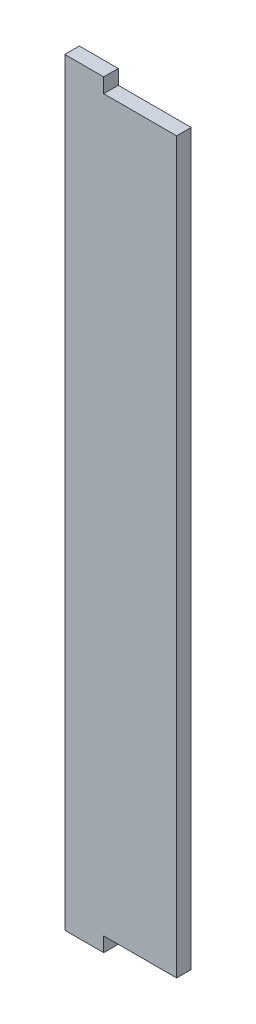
ISO-10303-21;
HEADER;
FILE_DESCRIPTION(('STEP AP214'),'2;1');
FILE_NAME('part.step','',(''),(''),'','','');
FILE_SCHEMA(('AUTOMOTIVE_DESIGN { 1 0 10303 214 1 1 1 1 }'));
ENDSEC;
DATA;
#1=APPLICATION_CONTEXT('core data for automotive mechanical design processes');
#2=APPLICATION_PROTOCOL_DEFINITION('international standard','automotive_design',2000,#1);
#3=PRODUCT_CONTEXT('',#1,'mechanical');
#4=PRODUCT('Part','Part','',(#3));
#5=PRODUCT_RELATED_PRODUCT_CATEGORY('part','',(#4));
#6=PRODUCT_DEFINITION_FORMATION('','',#4);
#7=PRODUCT_DEFINITION_CONTEXT('part definition',#1,'design');
#8=PRODUCT_DEFINITION('design','',#6,#7);
#9=PRODUCT_DEFINITION_SHAPE('','',#8);
#10=(LENGTH_UNIT() NAMED_UNIT(*) SI_UNIT(.MILLI.,.METRE.));
#11=(NAMED_UNIT(*) PLANE_ANGLE_UNIT() SI_UNIT($,.RADIAN.));
#12=(NAMED_UNIT(*) SI_UNIT($,.STERADIAN.) SOLID_ANGLE_UNIT());
#13=UNCERTAINTY_MEASURE_WITH_UNIT(LENGTH_MEASURE(1.E-05),#10,'distance_accuracy_value','');
#14=(GEOMETRIC_REPRESENTATION_CONTEXT(3) GLOBAL_UNCERTAINTY_ASSIGNED_CONTEXT((#13)) GLOBAL_UNIT_ASSIGNED_CONTEXT((#10,
#11,#12)) REPRESENTATION_CONTEXT('',''));
#15=CARTESIAN_POINT('',(0.,0.,0.));
#16=DIRECTION('',(0.,0.,1.));
#17=DIRECTION('',(1.,0.,0.));
#18=AXIS2_PLACEMENT_3D('',#15,#16,#17);
#19=CARTESIAN_POINT('',(-11.5,75.,3.));
#20=DIRECTION('',(0.,-1.,0.));
#21=DIRECTION('',(0.,0.,-1.));
#22=AXIS2_PLACEMENT_3D('',#19,#20,#21);
#23=PLANE('',#22);
#24=DIRECTION('',(0.,0.,-1.));
#25=VECTOR('',#24,1.);
#26=CARTESIAN_POINT('',(-3.50000000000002,75.,3.));
#27=LINE('',#26,#25);
#28=CARTESIAN_POINT('',(-3.50000000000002,75.,3.));
#29=VERTEX_POINT('',#28);
#30=CARTESIAN_POINT('',(-3.50000000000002,75.,0.));
#31=VERTEX_POINT('',#30);
#32=EDGE_CURVE('E58',#29,#31,#27,.T.);
#33=ORIENTED_EDGE('',*,*,#32,.F.);
#34=DIRECTION('',(-1.,0.,0.));
#35=VECTOR('',#34,1.);
#36=CARTESIAN_POINT('',(-11.5,75.,3.));
#37=LINE('',#36,#35);
#38=CARTESIAN_POINT('',(11.5,75.,3.));
#39=VERTEX_POINT('',#38);
#40=EDGE_CURVE('E114',#39,#29,#37,.T.);
#41=ORIENTED_EDGE('',*,*,#40,.F.);
#42=DIRECTION('',(0.,0.,-1.));
#43=VECTOR('',#42,1.);
#44=CARTESIAN_POINT('',(11.5,75.,3.));
#45=LINE('',#44,#43);
#46=CARTESIAN_POINT('',(11.5,75.,0.));
#47=VERTEX_POINT('',#46);
#48=EDGE_CURVE('E11',#39,#47,#45,.T.);
#49=ORIENTED_EDGE('',*,*,#48,.T.);
#50=DIRECTION('',(-1.,0.,0.));
#51=VECTOR('',#50,1.);
#52=CARTESIAN_POINT('',(-11.5,75.,0.));
#53=LINE('',#52,#51);
#54=EDGE_CURVE('E158',#47,#31,#53,.T.);
#55=ORIENTED_EDGE('',*,*,#54,.T.);
#56=EDGE_LOOP('',(#33,#41,#49,#55));
#57=FACE_BOUND('',#56,.T.);
#58=ADVANCED_FACE('F35',(#57),#23,.F.);
#59=CARTESIAN_POINT('',(11.5,-75.,3.));
#60=DIRECTION('',(-1.,0.,0.));
#61=DIRECTION('',(0.,0.,1.));
#62=AXIS2_PLACEMENT_3D('',#59,#60,#61);
#63=PLANE('',#62);
#64=DIRECTION('',(0.,1.,0.));
#65=VECTOR('',#64,1.);
#66=CARTESIAN_POINT('',(11.5,-75.,0.));
#67=LINE('',#66,#65);
#68=CARTESIAN_POINT('',(11.5,-75.,0.));
#69=VERTEX_POINT('',#68);
#70=EDGE_CURVE('E150',#69,#47,#67,.T.);
#71=ORIENTED_EDGE('',*,*,#70,.T.);
#72=ORIENTED_EDGE('',*,*,#48,.F.);
#73=DIRECTION('',(0.,1.,0.));
#74=VECTOR('',#73,1.);
#75=CARTESIAN_POINT('',(11.5,-75.,3.));
#76=LINE('',#75,#74);
#77=CARTESIAN_POINT('',(11.5,-75.,3.));
#78=VERTEX_POINT('',#77);
#79=EDGE_CURVE('E151',#78,#39,#76,.T.);
#80=ORIENTED_EDGE('',*,*,#79,.F.);
#81=DIRECTION('',(0.,0.,-1.));
#82=VECTOR('',#81,1.);
#83=CARTESIAN_POINT('',(11.5,-75.,3.));
#84=LINE('',#83,#82);
#85=EDGE_CURVE('E43',#78,#69,#84,.T.);
#86=ORIENTED_EDGE('',*,*,#85,.T.);
#87=EDGE_LOOP('',(#71,#72,#80,#86));
#88=FACE_BOUND('',#87,.T.);
#89=ADVANCED_FACE('F37',(#88),#63,.F.);
#90=CARTESIAN_POINT('',(-11.5,-75.,3.));
#91=DIRECTION('',(1.,0.,0.));
#92=DIRECTION('',(0.,0.,-1.));
#93=AXIS2_PLACEMENT_3D('',#90,#91,#92);
#94=PLANE('',#93);
#95=DIRECTION('',(0.,-1.,0.));
#96=VECTOR('',#95,1.);
#97=CARTESIAN_POINT('',(-11.5,-75.,0.));
#98=LINE('',#97,#96);
#99=CARTESIAN_POINT('',(-11.5,78.,0.));
#100=VERTEX_POINT('',#99);
#101=CARTESIAN_POINT('',(-11.5,-78.,0.));
#102=VERTEX_POINT('',#101);
#103=EDGE_CURVE('E119',#100,#102,#98,.T.);
#104=ORIENTED_EDGE('',*,*,#103,.T.);
#105=DIRECTION('',(0.,0.,-1.));
#106=VECTOR('',#105,1.);
#107=CARTESIAN_POINT('',(-11.5,-78.,3.));
#108=LINE('',#107,#106);
#109=CARTESIAN_POINT('',(-11.5,-78.,3.));
#110=VERTEX_POINT('',#109);
#111=EDGE_CURVE('E117',#110,#102,#108,.T.);
#112=ORIENTED_EDGE('',*,*,#111,.F.);
#113=DIRECTION('',(0.,-1.,0.));
#114=VECTOR('',#113,1.);
#115=CARTESIAN_POINT('',(-11.5,-75.,3.));
#116=LINE('',#115,#114);
#117=CARTESIAN_POINT('',(-11.5,78.,3.));
#118=VERTEX_POINT('',#117);
#119=EDGE_CURVE('E101',#118,#110,#116,.T.);
#120=ORIENTED_EDGE('',*,*,#119,.F.);
#121=DIRECTION('',(0.,0.,-1.));
#122=VECTOR('',#121,1.);
#123=CARTESIAN_POINT('',(-11.5,78.,3.));
#124=LINE('',#123,#122);
#125=EDGE_CURVE('E141',#118,#100,#124,.T.);
#126=ORIENTED_EDGE('',*,*,#125,.T.);
#127=EDGE_LOOP('',(#104,#112,#120,#126));
#128=FACE_BOUND('',#127,.T.);
#129=ADVANCED_FACE('F118',(#128),#94,.F.);
#130=CARTESIAN_POINT('',(-11.5,-75.,3.));
#131=DIRECTION('',(0.,1.,0.));
#132=DIRECTION('',(0.,0.,1.));
#133=AXIS2_PLACEMENT_3D('',#130,#131,#132);
#134=PLANE('',#133);
#135=DIRECTION('',(1.,0.,0.));
#136=VECTOR('',#135,1.);
#137=CARTESIAN_POINT('',(-11.5,-75.,3.));
#138=LINE('',#137,#136);
#139=CARTESIAN_POINT('',(-3.50000000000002,-75.,3.));
#140=VERTEX_POINT('',#139);
#141=EDGE_CURVE('E113',#140,#78,#138,.T.);
#142=ORIENTED_EDGE('',*,*,#141,.F.);
#143=DIRECTION('',(0.,0.,-1.));
#144=VECTOR('',#143,1.);
#145=CARTESIAN_POINT('',(-3.50000000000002,-75.,3.));
#146=LINE('',#145,#144);
#147=CARTESIAN_POINT('',(-3.50000000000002,-75.,0.));
#148=VERTEX_POINT('',#147);
#149=EDGE_CURVE('E129',#140,#148,#146,.T.);
#150=ORIENTED_EDGE('',*,*,#149,.T.);
#151=DIRECTION('',(1.,0.,0.));
#152=VECTOR('',#151,1.);
#153=CARTESIAN_POINT('',(-11.5,-75.,0.));
#154=LINE('',#153,#152);
#155=EDGE_CURVE('E153',#148,#69,#154,.T.);
#156=ORIENTED_EDGE('',*,*,#155,.T.);
#157=ORIENTED_EDGE('',*,*,#85,.F.);
#158=EDGE_LOOP('',(#142,#150,#156,#157));
#159=FACE_BOUND('',#158,.T.);
#160=ADVANCED_FACE('F175',(#159),#134,.F.);
#161=CARTESIAN_POINT('',(0.,0.,3.));
#162=DIRECTION('',(0.,0.,-1.));
#163=DIRECTION('',(-1.,0.,0.));
#164=AXIS2_PLACEMENT_3D('',#161,#162,#163);
#165=PLANE('',#164);
#166=ORIENTED_EDGE('',*,*,#79,.T.);
#167=ORIENTED_EDGE('',*,*,#40,.T.);
#168=DIRECTION('',(0.,1.,0.));
#169=VECTOR('',#168,1.);
#170=CARTESIAN_POINT('',(-3.50000000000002,75.,3.));
#171=LINE('',#170,#169);
#172=CARTESIAN_POINT('',(-3.50000000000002,78.,3.));
#173=VERTEX_POINT('',#172);
#174=EDGE_CURVE('E137',#29,#173,#171,.T.);
#175=ORIENTED_EDGE('',*,*,#174,.T.);
#176=DIRECTION('',(-1.,0.,0.));
#177=VECTOR('',#176,1.);
#178=CARTESIAN_POINT('',(-11.5,78.,3.));
#179=LINE('',#178,#177);
#180=EDGE_CURVE('E109',#173,#118,#179,.T.);
#181=ORIENTED_EDGE('',*,*,#180,.T.);
#182=ORIENTED_EDGE('',*,*,#119,.T.);
#183=DIRECTION('',(1.,0.,0.));
#184=VECTOR('',#183,1.);
#185=CARTESIAN_POINT('',(-11.5,-78.,3.));
#186=LINE('',#185,#184);
#187=CARTESIAN_POINT('',(-3.50000000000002,-78.,3.));
#188=VERTEX_POINT('',#187);
#189=EDGE_CURVE('E106',#110,#188,#186,.T.);
#190=ORIENTED_EDGE('',*,*,#189,.T.);
#191=DIRECTION('',(0.,1.,0.));
#192=VECTOR('',#191,1.);
#193=CARTESIAN_POINT('',(-3.50000000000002,-75.,3.));
#194=LINE('',#193,#192);
#195=EDGE_CURVE('E127',#188,#140,#194,.T.);
#196=ORIENTED_EDGE('',*,*,#195,.T.);
#197=ORIENTED_EDGE('',*,*,#141,.T.);
#198=EDGE_LOOP('',(#166,#167,#175,#181,#182,#190,#196,#197));
#199=FACE_BOUND('',#198,.T.);
#200=ADVANCED_FACE('F104',(#199),#165,.F.);
#201=CARTESIAN_POINT('',(0.,0.,0.));
#202=DIRECTION('',(0.,0.,-1.));
#203=DIRECTION('',(-1.,0.,0.));
#204=AXIS2_PLACEMENT_3D('',#201,#202,#203);
#205=PLANE('',#204);
#206=ORIENTED_EDGE('',*,*,#70,.F.);
#207=ORIENTED_EDGE('',*,*,#155,.F.);
#208=DIRECTION('',(0.,1.,0.));
#209=VECTOR('',#208,1.);
#210=CARTESIAN_POINT('',(-3.50000000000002,-75.,0.));
#211=LINE('',#210,#209);
#212=CARTESIAN_POINT('',(-3.50000000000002,-78.,0.));
#213=VERTEX_POINT('',#212);
#214=EDGE_CURVE('E50',#213,#148,#211,.T.);
#215=ORIENTED_EDGE('',*,*,#214,.F.);
#216=DIRECTION('',(1.,0.,0.));
#217=VECTOR('',#216,1.);
#218=CARTESIAN_POINT('',(-11.5,-78.,0.));
#219=LINE('',#218,#217);
#220=EDGE_CURVE('E131',#102,#213,#219,.T.);
#221=ORIENTED_EDGE('',*,*,#220,.F.);
#222=ORIENTED_EDGE('',*,*,#103,.F.);
#223=DIRECTION('',(-1.,0.,0.));
#224=VECTOR('',#223,1.);
#225=CARTESIAN_POINT('',(-11.5,78.,0.));
#226=LINE('',#225,#224);
#227=CARTESIAN_POINT('',(-3.50000000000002,78.,0.));
#228=VERTEX_POINT('',#227);
#229=EDGE_CURVE('E139',#228,#100,#226,.T.);
#230=ORIENTED_EDGE('',*,*,#229,.F.);
#231=DIRECTION('',(0.,1.,0.));
#232=VECTOR('',#231,1.);
#233=CARTESIAN_POINT('',(-3.50000000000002,75.,0.));
#234=LINE('',#233,#232);
#235=EDGE_CURVE('E122',#31,#228,#234,.T.);
#236=ORIENTED_EDGE('',*,*,#235,.F.);
#237=ORIENTED_EDGE('',*,*,#54,.F.);
#238=EDGE_LOOP('',(#206,#207,#215,#221,#222,#230,#236,#237));
#239=FACE_BOUND('',#238,.T.);
#240=ADVANCED_FACE('F171',(#239),#205,.T.);
#241=CARTESIAN_POINT('',(-3.50000000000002,75.,3.));
#242=DIRECTION('',(-1.,0.,0.));
#243=DIRECTION('',(0.,-1.,0.));
#244=AXIS2_PLACEMENT_3D('',#241,#242,#243);
#245=PLANE('',#244);
#246=ORIENTED_EDGE('',*,*,#235,.T.);
#247=DIRECTION('',(0.,0.,-1.));
#248=VECTOR('',#247,1.);
#249=CARTESIAN_POINT('',(-3.50000000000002,78.,3.));
#250=LINE('',#249,#248);
#251=EDGE_CURVE('E146',#173,#228,#250,.T.);
#252=ORIENTED_EDGE('',*,*,#251,.F.);
#253=ORIENTED_EDGE('',*,*,#174,.F.);
#254=ORIENTED_EDGE('',*,*,#32,.T.);
#255=EDGE_LOOP('',(#246,#252,#253,#254));
#256=FACE_BOUND('',#255,.T.);
#257=ADVANCED_FACE('F181',(#256),#245,.F.);
#258=CARTESIAN_POINT('',(-11.5,78.,3.));
#259=DIRECTION('',(0.,-1.,0.));
#260=DIRECTION('',(0.,0.,-1.));
#261=AXIS2_PLACEMENT_3D('',#258,#259,#260);
#262=PLANE('',#261);
#263=ORIENTED_EDGE('',*,*,#229,.T.);
#264=ORIENTED_EDGE('',*,*,#125,.F.);
#265=ORIENTED_EDGE('',*,*,#180,.F.);
#266=ORIENTED_EDGE('',*,*,#251,.T.);
#267=EDGE_LOOP('',(#263,#264,#265,#266));
#268=FACE_BOUND('',#267,.T.);
#269=ADVANCED_FACE('F178',(#268),#262,.F.);
#270=CARTESIAN_POINT('',(-11.5,-78.,3.));
#271=DIRECTION('',(0.,1.,0.));
#272=DIRECTION('',(0.,0.,1.));
#273=AXIS2_PLACEMENT_3D('',#270,#271,#272);
#274=PLANE('',#273);
#275=ORIENTED_EDGE('',*,*,#220,.T.);
#276=DIRECTION('',(0.,0.,-1.));
#277=VECTOR('',#276,1.);
#278=CARTESIAN_POINT('',(-3.50000000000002,-78.,3.));
#279=LINE('',#278,#277);
#280=EDGE_CURVE('E123',#188,#213,#279,.T.);
#281=ORIENTED_EDGE('',*,*,#280,.F.);
#282=ORIENTED_EDGE('',*,*,#189,.F.);
#283=ORIENTED_EDGE('',*,*,#111,.T.);
#284=EDGE_LOOP('',(#275,#281,#282,#283));
#285=FACE_BOUND('',#284,.T.);
#286=ADVANCED_FACE('F125',(#285),#274,.F.);
#287=CARTESIAN_POINT('',(-3.50000000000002,-75.,3.));
#288=DIRECTION('',(-1.,0.,0.));
#289=DIRECTION('',(0.,-1.,0.));
#290=AXIS2_PLACEMENT_3D('',#287,#288,#289);
#291=PLANE('',#290);
#292=ORIENTED_EDGE('',*,*,#214,.T.);
#293=ORIENTED_EDGE('',*,*,#149,.F.);
#294=ORIENTED_EDGE('',*,*,#195,.F.);
#295=ORIENTED_EDGE('',*,*,#280,.T.);
#296=EDGE_LOOP('',(#292,#293,#294,#295));
#297=FACE_BOUND('',#296,.T.);
#298=ADVANCED_FACE('F176',(#297),#291,.F.);
#299=CLOSED_SHELL('',(#58,#89,#129,#160,#200,#240,#257,#269,#286,#298));
#300=MANIFOLD_SOLID_BREP('B2',#299);
#301=ADVANCED_BREP_SHAPE_REPRESENTATION('',(#18,#300),#14);
#302=SHAPE_DEFINITION_REPRESENTATION(#9,#301);
ENDSEC;
END-ISO-10303-21;
